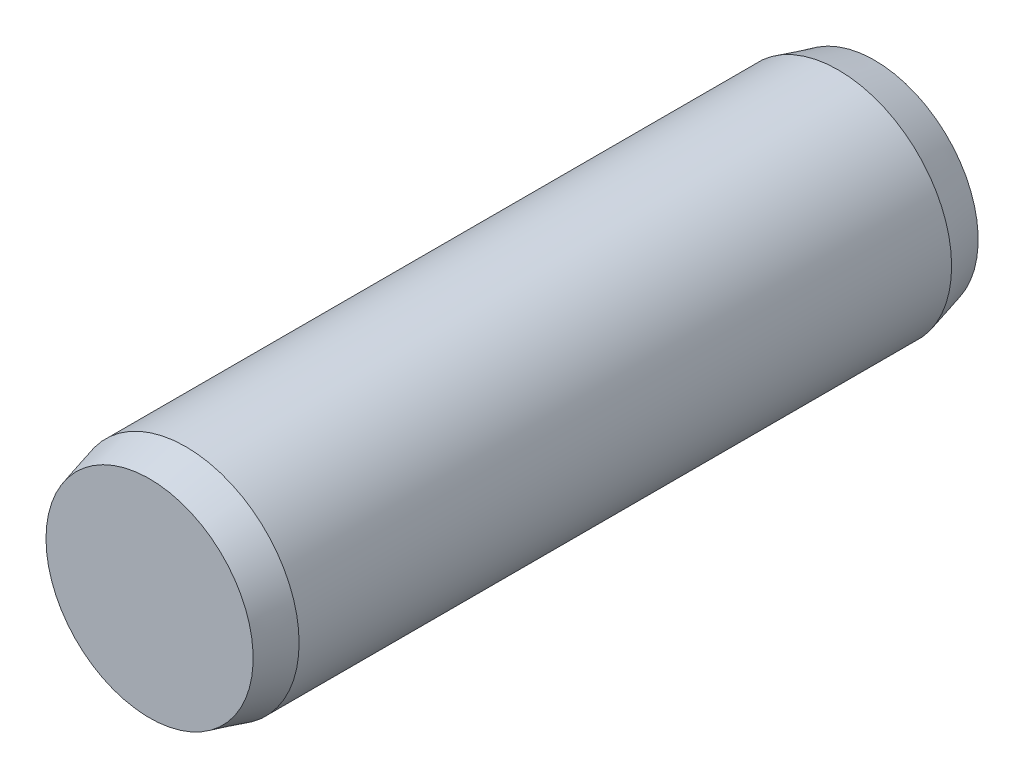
ISO-10303-21;
HEADER;
FILE_DESCRIPTION(('STEP AP214'),'2;1');
FILE_NAME('part.step','',(''),(''),'','','');
FILE_SCHEMA(('AUTOMOTIVE_DESIGN { 1 0 10303 214 1 1 1 1 }'));
ENDSEC;
DATA;
#1=APPLICATION_CONTEXT('core data for automotive mechanical design processes');
#2=APPLICATION_PROTOCOL_DEFINITION('international standard','automotive_design',2000,#1);
#3=PRODUCT_CONTEXT('',#1,'mechanical');
#4=PRODUCT('Part','Part','',(#3));
#5=PRODUCT_RELATED_PRODUCT_CATEGORY('part','',(#4));
#6=PRODUCT_DEFINITION_FORMATION('','',#4);
#7=PRODUCT_DEFINITION_CONTEXT('part definition',#1,'design');
#8=PRODUCT_DEFINITION('design','',#6,#7);
#9=PRODUCT_DEFINITION_SHAPE('','',#8);
#10=(LENGTH_UNIT() NAMED_UNIT(*) SI_UNIT(.MILLI.,.METRE.));
#11=(NAMED_UNIT(*) PLANE_ANGLE_UNIT() SI_UNIT($,.RADIAN.));
#12=(NAMED_UNIT(*) SI_UNIT($,.STERADIAN.) SOLID_ANGLE_UNIT());
#13=UNCERTAINTY_MEASURE_WITH_UNIT(LENGTH_MEASURE(1.E-05),#10,'distance_accuracy_value','');
#14=(GEOMETRIC_REPRESENTATION_CONTEXT(3) GLOBAL_UNCERTAINTY_ASSIGNED_CONTEXT((#13)) GLOBAL_UNIT_ASSIGNED_CONTEXT((#10,
#11,#12)) REPRESENTATION_CONTEXT('',''));
#15=CARTESIAN_POINT('',(0.,0.,0.));
#16=DIRECTION('',(0.,0.,1.));
#17=DIRECTION('',(1.,0.,0.));
#18=AXIS2_PLACEMENT_3D('',#15,#16,#17);
#19=CARTESIAN_POINT('',(0.,2.2856406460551,0.));
#20=DIRECTION('',(0.,0.,1.));
#21=DIRECTION('',(1.,0.,0.));
#22=AXIS2_PLACEMENT_3D('',#19,#20,#21);
#23=PLANE('',#22);
#24=CARTESIAN_POINT('',(0.,0.,0.));
#25=DIRECTION('',(0.,0.,-1.));
#26=DIRECTION('',(-1.,0.,0.));
#27=AXIS2_PLACEMENT_3D('',#24,#25,#26);
#28=CIRCLE('',#27,2.2856406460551);
#29=CARTESIAN_POINT('',(-2.2856406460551,0.,0.));
#30=VERTEX_POINT('',#29);
#31=EDGE_CURVE('E38',#30,#30,#28,.T.);
#32=ORIENTED_EDGE('',*,*,#31,.T.);
#33=EDGE_LOOP('',(#32));
#34=FACE_BOUND('',#33,.T.);
#35=ADVANCED_FACE('F15',(#34),#23,.F.);
#36=CARTESIAN_POINT('',(0.,0.,16.));
#37=DIRECTION('',(0.,0.,-1.));
#38=DIRECTION('',(-1.,0.,0.));
#39=AXIS2_PLACEMENT_3D('',#36,#37,#38);
#40=PLANE('',#39);
#41=CARTESIAN_POINT('',(0.,0.,16.));
#42=DIRECTION('',(0.,0.,-1.));
#43=DIRECTION('',(-1.,0.,0.));
#44=AXIS2_PLACEMENT_3D('',#41,#42,#43);
#45=CIRCLE('',#44,2.2856406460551);
#46=CARTESIAN_POINT('',(-2.2856406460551,0.,16.));
#47=VERTEX_POINT('',#46);
#48=EDGE_CURVE('E10',#47,#47,#45,.T.);
#49=ORIENTED_EDGE('',*,*,#48,.F.);
#50=EDGE_LOOP('',(#49));
#51=FACE_BOUND('',#50,.T.);
#52=ADVANCED_FACE('F62',(#51),#40,.F.);
#53=CARTESIAN_POINT('',(0.,0.,16.));
#54=DIRECTION('',(0.,0.,-1.));
#55=DIRECTION('',(-1.,0.,0.));
#56=AXIS2_PLACEMENT_3D('',#53,#54,#55);
#57=CONICAL_SURFACE('',#56,2.2856406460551,0.261799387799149);
#58=CARTESIAN_POINT('',(0.,0.,15.2));
#59=DIRECTION('',(0.,0.,-1.));
#60=DIRECTION('',(-1.,0.,0.));
#61=AXIS2_PLACEMENT_3D('',#58,#59,#60);
#62=CIRCLE('',#61,2.5);
#63=CARTESIAN_POINT('',(-2.5,0.,15.2));
#64=VERTEX_POINT('',#63);
#65=EDGE_CURVE('E22',#64,#64,#62,.T.);
#66=ORIENTED_EDGE('',*,*,#65,.F.);
#67=EDGE_LOOP('',(#66));
#68=FACE_BOUND('',#67,.T.);
#69=ORIENTED_EDGE('',*,*,#48,.T.);
#70=EDGE_LOOP('',(#69));
#71=FACE_BOUND('',#70,.T.);
#72=ADVANCED_FACE('F56',(#68,#71),#57,.T.);
#73=CARTESIAN_POINT('',(0.,0.,0.));
#74=DIRECTION('',(0.,0.,-1.));
#75=DIRECTION('',(-1.,0.,0.));
#76=AXIS2_PLACEMENT_3D('',#73,#74,#75);
#77=CYLINDRICAL_SURFACE('',#76,2.5);
#78=CARTESIAN_POINT('',(0.,0.,0.8));
#79=DIRECTION('',(0.,0.,-1.));
#80=DIRECTION('',(-1.,0.,0.));
#81=AXIS2_PLACEMENT_3D('',#78,#79,#80);
#82=CIRCLE('',#81,2.5);
#83=CARTESIAN_POINT('',(-2.5,0.,0.8));
#84=VERTEX_POINT('',#83);
#85=EDGE_CURVE('E31',#84,#84,#82,.T.);
#86=ORIENTED_EDGE('',*,*,#85,.F.);
#87=EDGE_LOOP('',(#86));
#88=FACE_BOUND('',#87,.T.);
#89=ORIENTED_EDGE('',*,*,#65,.T.);
#90=EDGE_LOOP('',(#89));
#91=FACE_BOUND('',#90,.T.);
#92=ADVANCED_FACE('F51',(#88,#91),#77,.T.);
#93=CARTESIAN_POINT('',(0.,0.,0.8));
#94=DIRECTION('',(0.,0.,1.));
#95=DIRECTION('',(1.,0.,0.));
#96=AXIS2_PLACEMENT_3D('',#93,#94,#95);
#97=CONICAL_SURFACE('',#96,2.5,0.261799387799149);
#98=ORIENTED_EDGE('',*,*,#31,.F.);
#99=EDGE_LOOP('',(#98));
#100=FACE_BOUND('',#99,.T.);
#101=ORIENTED_EDGE('',*,*,#85,.T.);
#102=EDGE_LOOP('',(#101));
#103=FACE_BOUND('',#102,.T.);
#104=ADVANCED_FACE('F48',(#100,#103),#97,.T.);
#105=CLOSED_SHELL('',(#35,#52,#72,#92,#104));
#106=MANIFOLD_SOLID_BREP('B1',#105);
#107=ADVANCED_BREP_SHAPE_REPRESENTATION('',(#18,#106),#14);
#108=SHAPE_DEFINITION_REPRESENTATION(#9,#107);
ENDSEC;
END-ISO-10303-21;
